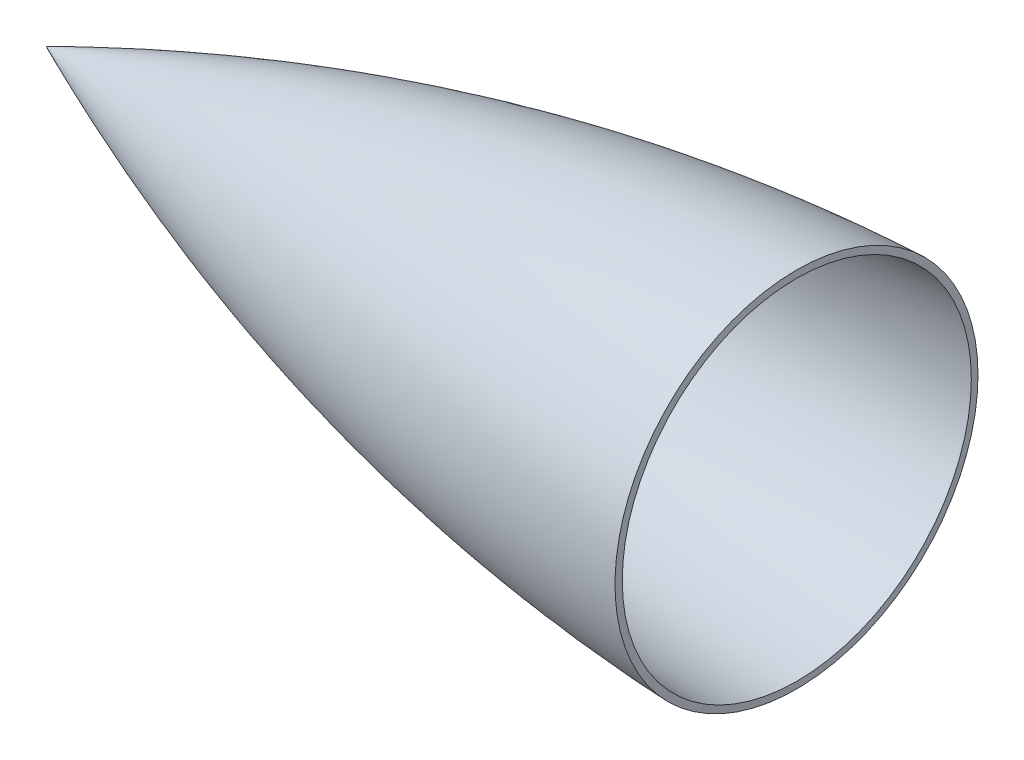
ISO-10303-21;
HEADER;
FILE_DESCRIPTION(('STEP AP214'),'2;1');
FILE_NAME('part.step','',(''),(''),'','','');
FILE_SCHEMA(('AUTOMOTIVE_DESIGN { 1 0 10303 214 1 1 1 1 }'));
ENDSEC;
DATA;
#1=APPLICATION_CONTEXT('core data for automotive mechanical design processes');
#2=APPLICATION_PROTOCOL_DEFINITION('international standard','automotive_design',2000,#1);
#3=PRODUCT_CONTEXT('',#1,'mechanical');
#4=PRODUCT('Part','Part','',(#3));
#5=PRODUCT_RELATED_PRODUCT_CATEGORY('part','',(#4));
#6=PRODUCT_DEFINITION_FORMATION('','',#4);
#7=PRODUCT_DEFINITION_CONTEXT('part definition',#1,'design');
#8=PRODUCT_DEFINITION('design','',#6,#7);
#9=PRODUCT_DEFINITION_SHAPE('','',#8);
#10=(LENGTH_UNIT() NAMED_UNIT(*) SI_UNIT(.MILLI.,.METRE.));
#11=(NAMED_UNIT(*) PLANE_ANGLE_UNIT() SI_UNIT($,.RADIAN.));
#12=(NAMED_UNIT(*) SI_UNIT($,.STERADIAN.) SOLID_ANGLE_UNIT());
#13=UNCERTAINTY_MEASURE_WITH_UNIT(LENGTH_MEASURE(1.E-05),#10,'distance_accuracy_value','');
#14=(GEOMETRIC_REPRESENTATION_CONTEXT(3) GLOBAL_UNCERTAINTY_ASSIGNED_CONTEXT((#13)) GLOBAL_UNIT_ASSIGNED_CONTEXT((#10,
#11,#12)) REPRESENTATION_CONTEXT('',''));
#15=CARTESIAN_POINT('',(0.,0.,0.));
#16=DIRECTION('',(0.,0.,1.));
#17=DIRECTION('',(1.,0.,0.));
#18=AXIS2_PLACEMENT_3D('',#15,#16,#17);
#19=CARTESIAN_POINT('',(107.499999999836,-2.58408745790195E-11,0.));
#20=DIRECTION('',(-1.,0.,0.));
#21=DIRECTION('',(0.,0.,1.));
#22=AXIS2_PLACEMENT_3D('',#19,#20,#21);
#23=CONICAL_SURFACE('',#22,25.9988750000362,1.52892082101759);
#24=CARTESIAN_POINT('',(107.541863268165,-2.58408745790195E-11,0.));
#25=DIRECTION('',(1.,0.,0.));
#26=DIRECTION('',(0.,1.,0.));
#27=AXIS2_PLACEMENT_3D('',#24,#25,#26);
#28=CIRCLE('',#27,24.9997516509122);
#29=CARTESIAN_POINT('',(107.541863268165,24.9997516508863,0.));
#30=VERTEX_POINT('',#29);
#31=EDGE_CURVE('E13',#30,#30,#28,.T.);
#32=ORIENTED_EDGE('',*,*,#31,.F.);
#33=EDGE_LOOP('',(#32));
#34=FACE_BOUND('',#33,.T.);
#35=CARTESIAN_POINT('',(107.499999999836,-2.58408745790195E-11,0.));
#36=DIRECTION('',(1.,0.,0.));
#37=DIRECTION('',(0.,0.,-1.));
#38=AXIS2_PLACEMENT_3D('',#35,#36,#37);
#39=CIRCLE('',#38,25.9988750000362);
#40=CARTESIAN_POINT('',(107.499999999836,-2.58408745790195E-11,-25.9988750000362));
#41=VERTEX_POINT('',#40);
#42=EDGE_CURVE('E51',#41,#41,#39,.T.);
#43=ORIENTED_EDGE('',*,*,#42,.T.);
#44=EDGE_LOOP('',(#43));
#45=FACE_BOUND('',#44,.T.);
#46=ADVANCED_FACE('F48',(#34,#45),#23,.T.);
#47=CARTESIAN_POINT('',(2.09482148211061,0.917329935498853,0.));
#48=CARTESIAN_POINT('',(54.7974107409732,23.7906365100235,0.));
#49=CARTESIAN_POINT('',(107.499999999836,25.9988750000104,0.));
#50=B_SPLINE_CURVE_WITH_KNOTS('',2,(#47,#48,#49),.UNSPECIFIED.,.F.,.F.,(3,3),
(0.0952515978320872,0.916266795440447),.UNSPECIFIED.);
#51=CARTESIAN_POINT('',(-5.8492273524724E-11,-2.58408745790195E-11,0.));
#52=DIRECTION('',(1.,0.,0.));
#53=AXIS1_PLACEMENT('',#51,#52);
#54=SURFACE_OF_REVOLUTION('',#50,#53);
#55=OFFSET_SURFACE('',#54,-1.,.F.);
#56=CARTESIAN_POINT('',(2.49294933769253,-2.58446692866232E-11,0.));
#57=VERTEX_POINT('',#56);
#58=VERTEX_LOOP('',#57);
#59=FACE_BOUND('',#58,.T.);
#60=ORIENTED_EDGE('',*,*,#31,.T.);
#61=EDGE_LOOP('',(#60));
#62=FACE_BOUND('',#61,.T.);
#63=ADVANCED_FACE('F65',(#59,#62),#55,.F.);
#64=CARTESIAN_POINT('',(-7.31142577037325E-11,-3.23027195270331E-11,0.));
#65=CARTESIAN_POINT('',(53.7499999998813,23.746749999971,0.));
#66=CARTESIAN_POINT('',(107.499999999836,25.9988750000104,0.));
#67=B_SPLINE_CURVE_WITH_KNOTS('',2,(#64,#65,#66),.UNSPECIFIED.,.F.,.F.,(3,3),
(0.0789347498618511,0.916266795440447),.UNSPECIFIED.);
#68=CARTESIAN_POINT('',(-5.8492273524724E-11,-2.58408745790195E-11,0.));
#69=DIRECTION('',(1.,0.,0.));
#70=AXIS1_PLACEMENT('',#68,#69);
#71=SURFACE_OF_REVOLUTION('',#67,#70);
#72=ORIENTED_EDGE('',*,*,#42,.F.);
#73=EDGE_LOOP('',(#72));
#74=FACE_BOUND('',#73,.T.);
#75=CARTESIAN_POINT('',(-7.31142577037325E-11,-3.23027195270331E-11,0.));
#76=VERTEX_POINT('',#75);
#77=VERTEX_LOOP('',#76);
#78=FACE_BOUND('',#77,.T.);
#79=ADVANCED_FACE('F63',(#74,#78),#71,.T.);
#80=CLOSED_SHELL('',(#46,#63,#79));
#81=MANIFOLD_SOLID_BREP('B2',#80);
#82=ADVANCED_BREP_SHAPE_REPRESENTATION('',(#18,#81),#14);
#83=SHAPE_DEFINITION_REPRESENTATION(#9,#82);
ENDSEC;
END-ISO-10303-21;
